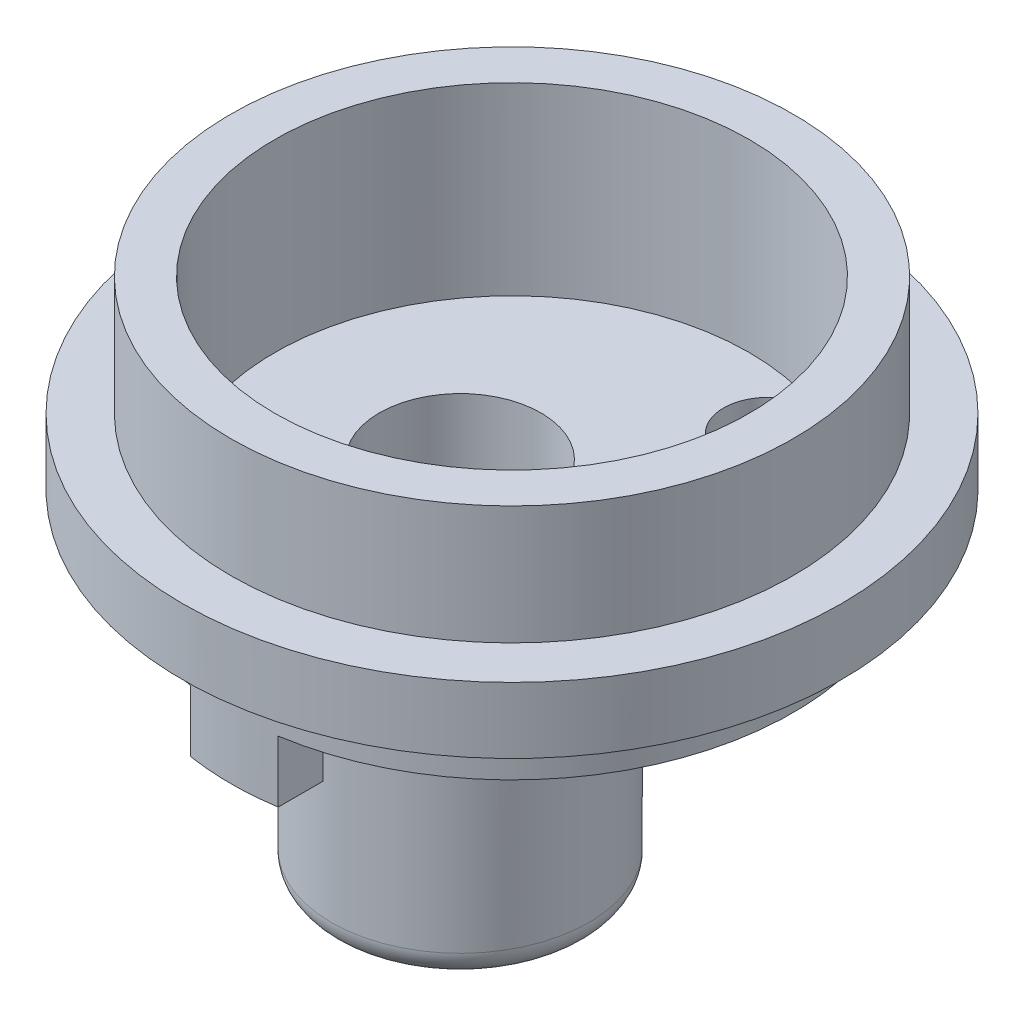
ISO-10303-21;
HEADER;
FILE_DESCRIPTION(('STEP AP214'),'2;1');
FILE_NAME('part.step','',(''),(''),'','','');
FILE_SCHEMA(('AUTOMOTIVE_DESIGN { 1 0 10303 214 1 1 1 1 }'));
ENDSEC;
DATA;
#1=APPLICATION_CONTEXT('core data for automotive mechanical design processes');
#2=APPLICATION_PROTOCOL_DEFINITION('international standard','automotive_design',2000,#1);
#3=PRODUCT_CONTEXT('',#1,'mechanical');
#4=PRODUCT('Part','Part','',(#3));
#5=PRODUCT_RELATED_PRODUCT_CATEGORY('part','',(#4));
#6=PRODUCT_DEFINITION_FORMATION('','',#4);
#7=PRODUCT_DEFINITION_CONTEXT('part definition',#1,'design');
#8=PRODUCT_DEFINITION('design','',#6,#7);
#9=PRODUCT_DEFINITION_SHAPE('','',#8);
#10=(LENGTH_UNIT() NAMED_UNIT(*) SI_UNIT(.MILLI.,.METRE.));
#11=(NAMED_UNIT(*) PLANE_ANGLE_UNIT() SI_UNIT($,.RADIAN.));
#12=(NAMED_UNIT(*) SI_UNIT($,.STERADIAN.) SOLID_ANGLE_UNIT());
#13=UNCERTAINTY_MEASURE_WITH_UNIT(LENGTH_MEASURE(1.E-05),#10,'distance_accuracy_value','');
#14=(GEOMETRIC_REPRESENTATION_CONTEXT(3) GLOBAL_UNCERTAINTY_ASSIGNED_CONTEXT((#13)) GLOBAL_UNIT_ASSIGNED_CONTEXT((#10,
#11,#12)) REPRESENTATION_CONTEXT('',''));
#15=CARTESIAN_POINT('',(0.,0.,0.));
#16=DIRECTION('',(0.,0.,1.));
#17=DIRECTION('',(1.,0.,0.));
#18=AXIS2_PLACEMENT_3D('',#15,#16,#17);
#19=CARTESIAN_POINT('',(0.,0.,0.));
#20=DIRECTION('',(0.,1.,0.));
#21=DIRECTION('',(0.,0.,1.));
#22=AXIS2_PLACEMENT_3D('',#19,#20,#21);
#23=PLANE('',#22);
#24=CARTESIAN_POINT('',(-1.4986,0.,0.));
#25=DIRECTION('',(0.,1.,0.));
#26=DIRECTION('',(0.,0.,1.));
#27=AXIS2_PLACEMENT_3D('',#24,#25,#26);
#28=CIRCLE('',#27,5.08);
#29=CARTESIAN_POINT('',(0.567898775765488,0.,4.64068775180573));
#30=VERTEX_POINT('',#29);
#31=CARTESIAN_POINT('',(0.567898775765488,0.,-4.64068775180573));
#32=VERTEX_POINT('',#31);
#33=EDGE_CURVE('E160',#30,#32,#28,.F.);
#34=ORIENTED_EDGE('',*,*,#33,.F.);
#35=CARTESIAN_POINT('',(2.28578474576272,0.,5.09911091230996));
#36=DIRECTION('',(0.,1.,0.));
#37=DIRECTION('',(0.,0.,1.));
#38=AXIS2_PLACEMENT_3D('',#35,#36,#37);
#39=CIRCLE('',#38,1.778);
#40=CARTESIAN_POINT('',(3.01307989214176,0.,6.72155529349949));
#41=VERTEX_POINT('',#40);
#42=EDGE_CURVE('E184',#30,#41,#39,.T.);
#43=ORIENTED_EDGE('',*,*,#42,.T.);
#44=CARTESIAN_POINT('',(0.,0.,0.));
#45=DIRECTION('',(0.,1.,0.));
#46=DIRECTION('',(0.,0.,1.));
#47=AXIS2_PLACEMENT_3D('',#44,#45,#46);
#48=CIRCLE('',#47,7.366);
#49=CARTESIAN_POINT('',(3.01307989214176,0.,-6.72155529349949));
#50=VERTEX_POINT('',#49);
#51=EDGE_CURVE('E180',#41,#50,#48,.T.);
#52=ORIENTED_EDGE('',*,*,#51,.T.);
#53=CARTESIAN_POINT('',(2.28578474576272,0.,-5.09911091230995));
#54=DIRECTION('',(0.,1.,0.));
#55=DIRECTION('',(0.,0.,1.));
#56=AXIS2_PLACEMENT_3D('',#53,#54,#55);
#57=CIRCLE('',#56,1.778);
#58=EDGE_CURVE('E182',#50,#32,#57,.T.);
#59=ORIENTED_EDGE('',*,*,#58,.T.);
#60=EDGE_LOOP('',(#34,#43,#52,#59));
#61=FACE_BOUND('',#60,.T.);
#62=CARTESIAN_POINT('',(0.,0.,0.));
#63=DIRECTION('',(0.,-1.,0.));
#64=DIRECTION('',(0.,0.,-1.));
#65=AXIS2_PLACEMENT_3D('',#62,#63,#64);
#66=CIRCLE('',#65,6.858);
#67=CARTESIAN_POINT('',(-1.27,0.,-6.73938157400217));
#68=VERTEX_POINT('',#67);
#69=CARTESIAN_POINT('',(1.27,0.,-6.73938157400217));
#70=VERTEX_POINT('',#69);
#71=EDGE_CURVE('E150',#68,#70,#66,.T.);
#72=ORIENTED_EDGE('',*,*,#71,.T.);
#73=DIRECTION('',(0.,0.,-1.));
#74=VECTOR('',#73,1.);
#75=CARTESIAN_POINT('',(1.27,0.,-6.73938157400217));
#76=LINE('',#75,#74);
#77=CARTESIAN_POINT('',(1.27,0.,-8.02816815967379));
#78=VERTEX_POINT('',#77);
#79=EDGE_CURVE('E134',#70,#78,#76,.T.);
#80=ORIENTED_EDGE('',*,*,#79,.T.);
#81=CARTESIAN_POINT('',(0.,0.,0.));
#82=DIRECTION('',(0.,1.,0.));
#83=DIRECTION('',(0.,0.,1.));
#84=AXIS2_PLACEMENT_3D('',#81,#82,#83);
#85=CIRCLE('',#84,8.128);
#86=CARTESIAN_POINT('',(1.27,0.,8.02816815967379));
#87=VERTEX_POINT('',#86);
#88=EDGE_CURVE('E147',#87,#78,#85,.T.);
#89=ORIENTED_EDGE('',*,*,#88,.F.);
#90=DIRECTION('',(0.,0.,-1.));
#91=VECTOR('',#90,1.);
#92=CARTESIAN_POINT('',(1.27,0.,8.02816815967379));
#93=LINE('',#92,#91);
#94=CARTESIAN_POINT('',(1.27,0.,6.73938157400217));
#95=VERTEX_POINT('',#94);
#96=EDGE_CURVE('E385',#87,#95,#93,.T.);
#97=ORIENTED_EDGE('',*,*,#96,.T.);
#98=CARTESIAN_POINT('',(0.,0.,0.));
#99=DIRECTION('',(0.,-1.,0.));
#100=DIRECTION('',(0.,0.,-1.));
#101=AXIS2_PLACEMENT_3D('',#98,#99,#100);
#102=CIRCLE('',#101,6.858);
#103=CARTESIAN_POINT('',(-1.27,0.,6.73938157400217));
#104=VERTEX_POINT('',#103);
#105=EDGE_CURVE('E382',#95,#104,#102,.T.);
#106=ORIENTED_EDGE('',*,*,#105,.T.);
#107=DIRECTION('',(0.,0.,-1.));
#108=VECTOR('',#107,1.);
#109=CARTESIAN_POINT('',(-1.27,0.,8.02816815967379));
#110=LINE('',#109,#108);
#111=CARTESIAN_POINT('',(-1.27,0.,8.02816815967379));
#112=VERTEX_POINT('',#111);
#113=EDGE_CURVE('E141',#112,#104,#110,.T.);
#114=ORIENTED_EDGE('',*,*,#113,.F.);
#115=CARTESIAN_POINT('',(-1.27,0.,-8.02816815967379));
#116=VERTEX_POINT('',#115);
#117=EDGE_CURVE('E157',#116,#112,#85,.T.);
#118=ORIENTED_EDGE('',*,*,#117,.F.);
#119=DIRECTION('',(0.,0.,-1.));
#120=VECTOR('',#119,1.);
#121=CARTESIAN_POINT('',(-1.27,0.,-6.73938157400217));
#122=LINE('',#121,#120);
#123=EDGE_CURVE('E364',#68,#116,#122,.T.);
#124=ORIENTED_EDGE('',*,*,#123,.F.);
#125=EDGE_LOOP('',(#72,#80,#89,#97,#106,#114,#118,#124));
#126=FACE_BOUND('',#125,.T.);
#127=ADVANCED_FACE('F28',(#61,#126),#23,.F.);
#128=CARTESIAN_POINT('',(0.,1.524,0.));
#129=DIRECTION('',(0.,-1.,0.));
#130=DIRECTION('',(0.,0.,-1.));
#131=AXIS2_PLACEMENT_3D('',#128,#129,#130);
#132=PLANE('',#131);
#133=CARTESIAN_POINT('',(-1.4986,1.524,0.));
#134=DIRECTION('',(0.,1.,0.));
#135=DIRECTION('',(-1.,0.,0.));
#136=AXIS2_PLACEMENT_3D('',#133,#134,#135);
#137=CIRCLE('',#136,2.33679999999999);
#138=CARTESIAN_POINT('',(-3.8354,1.524,0.));
#139=VERTEX_POINT('',#138);
#140=EDGE_CURVE('E295',#139,#139,#137,.T.);
#141=ORIENTED_EDGE('',*,*,#140,.F.);
#142=EDGE_LOOP('',(#141));
#143=FACE_BOUND('',#142,.T.);
#144=CARTESIAN_POINT('',(2.28578474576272,1.524,5.09911091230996));
#145=DIRECTION('',(0.,-1.,0.));
#146=DIRECTION('',(0.,0.,-1.));
#147=AXIS2_PLACEMENT_3D('',#144,#145,#146);
#148=CIRCLE('',#147,1.27);
#149=CARTESIAN_POINT('',(2.80528127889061,1.524,6.25799975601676));
#150=VERTEX_POINT('',#149);
#151=CARTESIAN_POINT('',(1.52890779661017,1.524,4.07928872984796));
#152=VERTEX_POINT('',#151);
#153=EDGE_CURVE('E320',#150,#152,#148,.T.);
#154=ORIENTED_EDGE('',*,*,#153,.T.);
#155=CARTESIAN_POINT('',(-1.4986,1.524,0.));
#156=DIRECTION('',(0.,1.,0.));
#157=DIRECTION('',(0.,0.,1.));
#158=AXIS2_PLACEMENT_3D('',#155,#156,#157);
#159=CIRCLE('',#158,5.08);
#160=CARTESIAN_POINT('',(1.52890779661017,1.524,-4.07928872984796));
#161=VERTEX_POINT('',#160);
#162=EDGE_CURVE('E323',#152,#161,#159,.T.);
#163=ORIENTED_EDGE('',*,*,#162,.T.);
#164=CARTESIAN_POINT('',(2.28578474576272,1.524,-5.09911091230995));
#165=DIRECTION('',(0.,1.,0.));
#166=DIRECTION('',(0.,0.,1.));
#167=AXIS2_PLACEMENT_3D('',#164,#165,#166);
#168=CIRCLE('',#167,1.27);
#169=CARTESIAN_POINT('',(2.80528127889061,1.524,-6.25799975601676));
#170=VERTEX_POINT('',#169);
#171=EDGE_CURVE('E328',#170,#161,#168,.T.);
#172=ORIENTED_EDGE('',*,*,#171,.F.);
#173=CARTESIAN_POINT('',(0.,1.524,0.));
#174=DIRECTION('',(0.,-1.,0.));
#175=DIRECTION('',(0.,0.,-1.));
#176=AXIS2_PLACEMENT_3D('',#173,#174,#175);
#177=CIRCLE('',#176,6.858);
#178=EDGE_CURVE('E238',#150,#170,#177,.T.);
#179=ORIENTED_EDGE('',*,*,#178,.F.);
#180=EDGE_LOOP('',(#154,#163,#172,#179));
#181=FACE_BOUND('',#180,.T.);
#182=ADVANCED_FACE('F213',(#143,#181),#132,.F.);
#183=CARTESIAN_POINT('',(0.,6.858,0.));
#184=DIRECTION('',(0.,-1.,0.));
#185=DIRECTION('',(0.,0.,-1.));
#186=AXIS2_PLACEMENT_3D('',#183,#184,#185);
#187=CYLINDRICAL_SURFACE('',#186,8.128);
#188=CARTESIAN_POINT('',(0.,1.524,0.));
#189=DIRECTION('',(0.,-1.,0.));
#190=DIRECTION('',(0.,0.,-1.));
#191=AXIS2_PLACEMENT_3D('',#188,#189,#190);
#192=CIRCLE('',#191,8.128);
#193=CARTESIAN_POINT('',(0.,1.524,-8.128));
#194=VERTEX_POINT('',#193);
#195=EDGE_CURVE('E171',#194,#194,#192,.T.);
#196=ORIENTED_EDGE('',*,*,#195,.T.);
#197=EDGE_LOOP('',(#196));
#198=FACE_BOUND('',#197,.T.);
#199=ORIENTED_EDGE('',*,*,#88,.T.);
#200=DIRECTION('',(0.,1.,0.));
#201=VECTOR('',#200,1.);
#202=CARTESIAN_POINT('',(1.27,-1.778,-8.02816815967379));
#203=LINE('',#202,#201);
#204=CARTESIAN_POINT('',(1.27,-1.778,-8.02816815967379));
#205=VERTEX_POINT('',#204);
#206=EDGE_CURVE('E131',#205,#78,#203,.T.);
#207=ORIENTED_EDGE('',*,*,#206,.F.);
#208=CARTESIAN_POINT('',(0.,-1.778,0.));
#209=DIRECTION('',(0.,-1.,0.));
#210=DIRECTION('',(0.,0.,-1.));
#211=AXIS2_PLACEMENT_3D('',#208,#209,#210);
#212=CIRCLE('',#211,8.128);
#213=CARTESIAN_POINT('',(-1.27,-1.778,-8.02816815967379));
#214=VERTEX_POINT('',#213);
#215=EDGE_CURVE('E367',#214,#205,#212,.T.);
#216=ORIENTED_EDGE('',*,*,#215,.F.);
#217=DIRECTION('',(0.,1.,0.));
#218=VECTOR('',#217,1.);
#219=CARTESIAN_POINT('',(-1.27,-1.778,-8.02816815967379));
#220=LINE('',#219,#218);
#221=EDGE_CURVE('E375',#214,#116,#220,.T.);
#222=ORIENTED_EDGE('',*,*,#221,.T.);
#223=ORIENTED_EDGE('',*,*,#117,.T.);
#224=DIRECTION('',(0.,1.,0.));
#225=VECTOR('',#224,1.);
#226=CARTESIAN_POINT('',(-1.27,-1.778,8.02816815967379));
#227=LINE('',#226,#225);
#228=CARTESIAN_POINT('',(-1.27,-1.778,8.02816815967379));
#229=VERTEX_POINT('',#228);
#230=EDGE_CURVE('E326',#229,#112,#227,.T.);
#231=ORIENTED_EDGE('',*,*,#230,.F.);
#232=CARTESIAN_POINT('',(0.,-1.778,0.));
#233=DIRECTION('',(0.,-1.,0.));
#234=DIRECTION('',(0.,0.,-1.));
#235=AXIS2_PLACEMENT_3D('',#232,#233,#234);
#236=CIRCLE('',#235,8.128);
#237=CARTESIAN_POINT('',(1.27,-1.778,8.02816815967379));
#238=VERTEX_POINT('',#237);
#239=EDGE_CURVE('E387',#238,#229,#236,.T.);
#240=ORIENTED_EDGE('',*,*,#239,.F.);
#241=DIRECTION('',(0.,1.,0.));
#242=VECTOR('',#241,1.);
#243=CARTESIAN_POINT('',(1.27,-1.778,8.02816815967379));
#244=LINE('',#243,#242);
#245=EDGE_CURVE('E155',#238,#87,#244,.T.);
#246=ORIENTED_EDGE('',*,*,#245,.T.);
#247=EDGE_LOOP('',(#199,#207,#216,#222,#223,#231,#240,#246));
#248=FACE_BOUND('',#247,.T.);
#249=ADVANCED_FACE('F30',(#198,#248),#187,.T.);
#250=CARTESIAN_POINT('',(-1.4986,-2.54,0.));
#251=DIRECTION('',(0.,1.,0.));
#252=DIRECTION('',(0.,0.,1.));
#253=AXIS2_PLACEMENT_3D('',#250,#251,#252);
#254=CYLINDRICAL_SURFACE('',#253,5.08);
#255=DIRECTION('',(0.,1.,0.));
#256=VECTOR('',#255,1.);
#257=CARTESIAN_POINT('',(1.52890779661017,-8.9662,4.07928872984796));
#258=LINE('',#257,#256);
#259=CARTESIAN_POINT('',(1.52890779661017,0.508,4.07928872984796));
#260=VERTEX_POINT('',#259);
#261=EDGE_CURVE('E300',#260,#152,#258,.T.);
#262=ORIENTED_EDGE('',*,*,#261,.F.);
#263=CARTESIAN_POINT('',(0.567898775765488,0.,4.64068775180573));
#264=CARTESIAN_POINT('',(0.618864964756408,5.12373952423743E-05,4.61801161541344));
#265=CARTESIAN_POINT('',(0.669077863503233,0.00553166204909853,4.59462833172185));
#266=CARTESIAN_POINT('',(0.766715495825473,0.0249706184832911,4.5472627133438));
#267=CARTESIAN_POINT('',(0.814169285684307,0.0388102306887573,4.52329322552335));
#268=CARTESIAN_POINT('',(0.941170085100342,0.0854665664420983,4.45671525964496));
#269=CARTESIAN_POINT('',(1.01800450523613,0.124727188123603,4.41365014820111));
#270=CARTESIAN_POINT('',(1.16492275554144,0.214242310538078,4.32659484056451));
#271=CARTESIAN_POINT('',(1.23494680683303,0.264583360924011,4.28259997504));
#272=CARTESIAN_POINT('',(1.37918595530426,0.377555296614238,4.18726831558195));
#273=CARTESIAN_POINT('',(1.45268033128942,0.440926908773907,4.13574536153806));
#274=CARTESIAN_POINT('',(1.52612075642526,0.505546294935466,4.0813560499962));
#275=CARTESIAN_POINT('',(1.52751454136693,0.506773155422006,4.08032273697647));
#276=CARTESIAN_POINT('',(1.52890779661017,0.508,4.07928872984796));
#277=B_SPLINE_CURVE_WITH_KNOTS('',3,(#263,#264,#265,#266,#267,#268,#269,#270,#271,#272,#273,
#274,#275,#276),.UNSPECIFIED.,.F.,.F.,(4,2,2,2,2,2,4),(0.,0.166504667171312,0.3306946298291,
0.618403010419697,0.908443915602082,1.23784315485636,1.24421810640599),.UNSPECIFIED.);
#278=EDGE_CURVE('E189',#260,#30,#277,.F.);
#279=ORIENTED_EDGE('',*,*,#278,.T.);
#280=ORIENTED_EDGE('',*,*,#33,.T.);
#281=CARTESIAN_POINT('',(0.567898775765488,0.,-4.64068775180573));
#282=CARTESIAN_POINT('',(0.618864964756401,5.12373952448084E-05,-4.61801161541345));
#283=CARTESIAN_POINT('',(0.669077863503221,0.00553166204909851,-4.59462833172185));
#284=CARTESIAN_POINT('',(0.766715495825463,0.0249706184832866,-4.54726271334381));
#285=CARTESIAN_POINT('',(0.814169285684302,0.0388102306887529,-4.52329322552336));
#286=CARTESIAN_POINT('',(0.941170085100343,0.0854665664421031,-4.45671525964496));
#287=CARTESIAN_POINT('',(1.01800450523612,0.124727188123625,-4.41365014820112));
#288=CARTESIAN_POINT('',(1.16492275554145,0.214242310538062,-4.3265948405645));
#289=CARTESIAN_POINT('',(1.23494680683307,0.264583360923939,-4.28259997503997));
#290=CARTESIAN_POINT('',(1.37918595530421,0.377555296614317,-4.18726831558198));
#291=CARTESIAN_POINT('',(1.45268033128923,0.440926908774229,-4.13574536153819));
#292=CARTESIAN_POINT('',(1.52612075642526,0.505546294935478,-4.08135604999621));
#293=CARTESIAN_POINT('',(1.52751454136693,0.506773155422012,-4.08032273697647));
#294=CARTESIAN_POINT('',(1.52890779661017,0.508,-4.07928872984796));
#295=B_SPLINE_CURVE_WITH_KNOTS('',3,(#281,#282,#283,#284,#285,#286,#287,#288,#289,#290,#291,
#292,#293,#294),.UNSPECIFIED.,.F.,.F.,(4,2,2,2,2,2,4),(0.,0.166504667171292,0.330694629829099,
0.61840301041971,0.908443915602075,1.23784315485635,1.24421810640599),.UNSPECIFIED.);
#296=CARTESIAN_POINT('',(1.52890779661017,0.508,-4.07928872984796));
#297=VERTEX_POINT('',#296);
#298=EDGE_CURVE('E43',#32,#297,#295,.T.);
#299=ORIENTED_EDGE('',*,*,#298,.T.);
#300=DIRECTION('',(0.,1.,0.));
#301=VECTOR('',#300,1.);
#302=CARTESIAN_POINT('',(1.52890779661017,-8.9662,-4.07928872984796));
#303=LINE('',#302,#301);
#304=EDGE_CURVE('E341',#297,#161,#303,.T.);
#305=ORIENTED_EDGE('',*,*,#304,.T.);
#306=ORIENTED_EDGE('',*,*,#162,.F.);
#307=EDGE_LOOP('',(#262,#279,#280,#299,#305,#306));
#308=FACE_BOUND('',#307,.T.);
#309=CARTESIAN_POINT('',(-1.4986,-2.54,0.));
#310=DIRECTION('',(0.,-1.,0.));
#311=DIRECTION('',(0.,0.,-1.));
#312=AXIS2_PLACEMENT_3D('',#309,#310,#311);
#313=CIRCLE('',#312,5.08);
#314=CARTESIAN_POINT('',(-1.4986,-2.54,-5.08));
#315=VERTEX_POINT('',#314);
#316=EDGE_CURVE('E162',#315,#315,#313,.T.);
#317=ORIENTED_EDGE('',*,*,#316,.F.);
#318=EDGE_LOOP('',(#317));
#319=FACE_BOUND('',#318,.T.);
#320=ADVANCED_FACE('F204',(#308,#319),#254,.T.);
#321=CARTESIAN_POINT('',(-1.4986,-2.54,0.));
#322=DIRECTION('',(0.,-1.,0.));
#323=DIRECTION('',(0.,0.,-1.));
#324=AXIS2_PLACEMENT_3D('',#321,#322,#323);
#325=PLANE('',#324);
#326=CARTESIAN_POINT('',(-1.4986,-2.54,0.));
#327=DIRECTION('',(0.,-1.,0.));
#328=DIRECTION('',(0.,0.,-1.));
#329=AXIS2_PLACEMENT_3D('',#326,#327,#328);
#330=CIRCLE('',#329,3.72467038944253);
#331=CARTESIAN_POINT('',(-1.4986,-2.54,-3.72467038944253));
#332=VERTEX_POINT('',#331);
#333=EDGE_CURVE('E167',#332,#332,#330,.T.);
#334=ORIENTED_EDGE('',*,*,#333,.F.);
#335=EDGE_LOOP('',(#334));
#336=FACE_BOUND('',#335,.T.);
#337=ORIENTED_EDGE('',*,*,#316,.T.);
#338=EDGE_LOOP('',(#337));
#339=FACE_BOUND('',#338,.T.);
#340=ADVANCED_FACE('F209',(#336,#339),#325,.T.);
#341=CARTESIAN_POINT('',(-1.4986,-8.9662,0.));
#342=DIRECTION('',(0.,1.,0.));
#343=DIRECTION('',(0.,0.,1.));
#344=AXIS2_PLACEMENT_3D('',#341,#342,#343);
#345=CYLINDRICAL_SURFACE('',#344,3.72467038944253);
#346=CARTESIAN_POINT('',(-1.4986,-8.2042,0.));
#347=DIRECTION('',(0.,1.,0.));
#348=DIRECTION('',(0.,0.,1.));
#349=AXIS2_PLACEMENT_3D('',#346,#347,#348);
#350=CIRCLE('',#349,3.72467038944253);
#351=CARTESIAN_POINT('',(-1.4986,-8.2042,3.72467038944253));
#352=VERTEX_POINT('',#351);
#353=EDGE_CURVE('E36',#352,#352,#350,.T.);
#354=ORIENTED_EDGE('',*,*,#353,.T.);
#355=EDGE_LOOP('',(#354));
#356=FACE_BOUND('',#355,.T.);
#357=ORIENTED_EDGE('',*,*,#333,.T.);
#358=EDGE_LOOP('',(#357));
#359=FACE_BOUND('',#358,.T.);
#360=ADVANCED_FACE('F262',(#356,#359),#345,.T.);
#361=CARTESIAN_POINT('',(-1.4986,-8.9662,0.));
#362=DIRECTION('',(0.,1.,0.));
#363=DIRECTION('',(0.,0.,1.));
#364=AXIS2_PLACEMENT_3D('',#361,#362,#363);
#365=PLANE('',#364);
#366=CARTESIAN_POINT('',(-1.4986,-8.9662,0.));
#367=DIRECTION('',(0.,1.,0.));
#368=DIRECTION('',(0.,0.,1.));
#369=AXIS2_PLACEMENT_3D('',#366,#367,#368);
#370=CIRCLE('',#369,2.96267038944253);
#371=CARTESIAN_POINT('',(-1.4986,-8.9662,2.96267038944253));
#372=VERTEX_POINT('',#371);
#373=EDGE_CURVE('E11',#372,#372,#370,.F.);
#374=ORIENTED_EDGE('',*,*,#373,.T.);
#375=EDGE_LOOP('',(#374));
#376=FACE_BOUND('',#375,.T.);
#377=CARTESIAN_POINT('',(-1.4986,-8.9662,0.));
#378=DIRECTION('',(0.,1.,0.));
#379=DIRECTION('',(-1.,0.,0.));
#380=AXIS2_PLACEMENT_3D('',#377,#378,#379);
#381=CIRCLE('',#380,1.9304);
#382=CARTESIAN_POINT('',(-3.429,-8.9662,0.));
#383=VERTEX_POINT('',#382);
#384=EDGE_CURVE('E292',#383,#383,#381,.T.);
#385=ORIENTED_EDGE('',*,*,#384,.T.);
#386=EDGE_LOOP('',(#385));
#387=FACE_BOUND('',#386,.T.);
#388=ADVANCED_FACE('F253',(#376,#387),#365,.F.);
#389=CARTESIAN_POINT('',(0.,3.429,0.));
#390=DIRECTION('',(0.,1.,0.));
#391=DIRECTION('',(0.,0.,1.));
#392=AXIS2_PLACEMENT_3D('',#389,#390,#391);
#393=PLANE('',#392);
#394=CARTESIAN_POINT('',(0.,3.429,0.));
#395=DIRECTION('',(0.,1.,0.));
#396=DIRECTION('',(0.,0.,1.));
#397=AXIS2_PLACEMENT_3D('',#394,#395,#396);
#398=CIRCLE('',#397,9.525);
#399=CARTESIAN_POINT('',(0.,3.429,9.525));
#400=VERTEX_POINT('',#399);
#401=EDGE_CURVE('E175',#400,#400,#398,.F.);
#402=ORIENTED_EDGE('',*,*,#401,.F.);
#403=EDGE_LOOP('',(#402));
#404=FACE_BOUND('',#403,.T.);
#405=CARTESIAN_POINT('',(0.,3.429,0.));
#406=DIRECTION('',(0.,1.,0.));
#407=DIRECTION('',(0.,0.,1.));
#408=AXIS2_PLACEMENT_3D('',#405,#406,#407);
#409=CIRCLE('',#408,8.128);
#410=CARTESIAN_POINT('',(0.,3.429,8.128));
#411=VERTEX_POINT('',#410);
#412=EDGE_CURVE('E174',#411,#411,#409,.T.);
#413=ORIENTED_EDGE('',*,*,#412,.F.);
#414=EDGE_LOOP('',(#413));
#415=FACE_BOUND('',#414,.T.);
#416=ADVANCED_FACE('F250',(#404,#415),#393,.T.);
#417=CARTESIAN_POINT('',(0.,1.524,0.));
#418=DIRECTION('',(0.,-1.,0.));
#419=DIRECTION('',(0.,0.,-1.));
#420=AXIS2_PLACEMENT_3D('',#417,#418,#419);
#421=PLANE('',#420);
#422=CARTESIAN_POINT('',(0.,1.524,0.));
#423=DIRECTION('',(0.,-1.,0.));
#424=DIRECTION('',(0.,0.,-1.));
#425=AXIS2_PLACEMENT_3D('',#422,#423,#424);
#426=CIRCLE('',#425,9.525);
#427=CARTESIAN_POINT('',(0.,1.524,-9.525));
#428=VERTEX_POINT('',#427);
#429=EDGE_CURVE('E237',#428,#428,#426,.T.);
#430=ORIENTED_EDGE('',*,*,#429,.T.);
#431=EDGE_LOOP('',(#430));
#432=FACE_BOUND('',#431,.T.);
#433=ORIENTED_EDGE('',*,*,#195,.F.);
#434=EDGE_LOOP('',(#433));
#435=FACE_BOUND('',#434,.T.);
#436=ADVANCED_FACE('F227',(#432,#435),#421,.T.);
#437=CARTESIAN_POINT('',(0.,33.7987683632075,0.));
#438=DIRECTION('',(0.,-1.,0.));
#439=DIRECTION('',(0.,0.,-1.));
#440=AXIS2_PLACEMENT_3D('',#437,#438,#439);
#441=CYLINDRICAL_SURFACE('',#440,9.525);
#442=ORIENTED_EDGE('',*,*,#429,.F.);
#443=EDGE_LOOP('',(#442));
#444=FACE_BOUND('',#443,.T.);
#445=ORIENTED_EDGE('',*,*,#401,.T.);
#446=EDGE_LOOP('',(#445));
#447=FACE_BOUND('',#446,.T.);
#448=ADVANCED_FACE('F218',(#444,#447),#441,.T.);
#449=CARTESIAN_POINT('',(0.,6.858,0.));
#450=DIRECTION('',(0.,1.,0.));
#451=DIRECTION('',(0.,0.,1.));
#452=AXIS2_PLACEMENT_3D('',#449,#450,#451);
#453=PLANE('',#452);
#454=CARTESIAN_POINT('',(0.,6.858,0.));
#455=DIRECTION('',(0.,-1.,0.));
#456=DIRECTION('',(0.,0.,-1.));
#457=AXIS2_PLACEMENT_3D('',#454,#455,#456);
#458=CIRCLE('',#457,6.858);
#459=CARTESIAN_POINT('',(0.,6.858,-6.858));
#460=VERTEX_POINT('',#459);
#461=EDGE_CURVE('E233',#460,#460,#458,.T.);
#462=ORIENTED_EDGE('',*,*,#461,.T.);
#463=EDGE_LOOP('',(#462));
#464=FACE_BOUND('',#463,.T.);
#465=CARTESIAN_POINT('',(0.,6.858,0.));
#466=DIRECTION('',(0.,1.,0.));
#467=DIRECTION('',(0.,0.,1.));
#468=AXIS2_PLACEMENT_3D('',#465,#466,#467);
#469=CIRCLE('',#468,8.128);
#470=CARTESIAN_POINT('',(0.,6.858,8.128));
#471=VERTEX_POINT('',#470);
#472=EDGE_CURVE('E156',#471,#471,#469,.T.);
#473=ORIENTED_EDGE('',*,*,#472,.T.);
#474=EDGE_LOOP('',(#473));
#475=FACE_BOUND('',#474,.T.);
#476=ADVANCED_FACE('F215',(#464,#475),#453,.T.);
#477=ORIENTED_EDGE('',*,*,#412,.T.);
#478=EDGE_LOOP('',(#477));
#479=FACE_BOUND('',#478,.T.);
#480=ORIENTED_EDGE('',*,*,#472,.F.);
#481=EDGE_LOOP('',(#480));
#482=FACE_BOUND('',#481,.T.);
#483=ADVANCED_FACE('F217',(#479,#482),#187,.T.);
#484=CARTESIAN_POINT('',(0.,6.858,0.));
#485=DIRECTION('',(0.,-1.,0.));
#486=DIRECTION('',(0.,0.,-1.));
#487=AXIS2_PLACEMENT_3D('',#484,#485,#486);
#488=CYLINDRICAL_SURFACE('',#487,6.858);
#489=ORIENTED_EDGE('',*,*,#461,.F.);
#490=EDGE_LOOP('',(#489));
#491=FACE_BOUND('',#490,.T.);
#492=DIRECTION('',(0.,1.,0.));
#493=VECTOR('',#492,1.);
#494=CARTESIAN_POINT('',(2.80528127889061,-8.9662,-6.25799975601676));
#495=LINE('',#494,#493);
#496=CARTESIAN_POINT('',(2.80528127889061,0.508,-6.25799975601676));
#497=VERTEX_POINT('',#496);
#498=EDGE_CURVE('E339',#497,#170,#495,.T.);
#499=ORIENTED_EDGE('',*,*,#498,.F.);
#500=CARTESIAN_POINT('',(0.,0.508,0.));
#501=DIRECTION('',(0.,1.,0.));
#502=DIRECTION('',(0.,0.,1.));
#503=AXIS2_PLACEMENT_3D('',#500,#501,#502);
#504=CIRCLE('',#503,6.858);
#505=CARTESIAN_POINT('',(2.80528127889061,0.508,6.25799975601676));
#506=VERTEX_POINT('',#505);
#507=EDGE_CURVE('E187',#497,#506,#504,.F.);
#508=ORIENTED_EDGE('',*,*,#507,.T.);
#509=DIRECTION('',(0.,1.,0.));
#510=VECTOR('',#509,1.);
#511=CARTESIAN_POINT('',(2.80528127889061,-8.9662,6.25799975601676));
#512=LINE('',#511,#510);
#513=EDGE_CURVE('E337',#506,#150,#512,.T.);
#514=ORIENTED_EDGE('',*,*,#513,.T.);
#515=ORIENTED_EDGE('',*,*,#178,.T.);
#516=EDGE_LOOP('',(#499,#508,#514,#515));
#517=FACE_BOUND('',#516,.T.);
#518=ADVANCED_FACE('F224',(#491,#517),#488,.F.);
#519=CARTESIAN_POINT('',(-1.4986,5.36518646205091,0.));
#520=DIRECTION('',(0.,1.,0.));
#521=DIRECTION('',(-1.,0.,0.));
#522=AXIS2_PLACEMENT_3D('',#519,#520,#521);
#523=CYLINDRICAL_SURFACE('',#522,2.33679999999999);
#524=CARTESIAN_POINT('',(-1.4986,-3.81,0.));
#525=DIRECTION('',(0.,1.,0.));
#526=DIRECTION('',(-1.,0.,0.));
#527=AXIS2_PLACEMENT_3D('',#524,#525,#526);
#528=CIRCLE('',#527,2.3368);
#529=CARTESIAN_POINT('',(-3.8354,-3.81,0.));
#530=VERTEX_POINT('',#529);
#531=EDGE_CURVE('E243',#530,#530,#528,.T.);
#532=ORIENTED_EDGE('',*,*,#531,.F.);
#533=EDGE_LOOP('',(#532));
#534=FACE_BOUND('',#533,.T.);
#535=ORIENTED_EDGE('',*,*,#140,.T.);
#536=EDGE_LOOP('',(#535));
#537=FACE_BOUND('',#536,.T.);
#538=ADVANCED_FACE('F308',(#534,#537),#523,.F.);
#539=CARTESIAN_POINT('',(-1.4986,-3.81,0.));
#540=DIRECTION('',(0.,1.,0.));
#541=DIRECTION('',(-1.,0.,0.));
#542=AXIS2_PLACEMENT_3D('',#539,#540,#541);
#543=CONICAL_SURFACE('',#542,2.33679999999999,0.132481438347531);
#544=CARTESIAN_POINT('',(-1.4986,-6.85963169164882,0.));
#545=DIRECTION('',(0.,1.,0.));
#546=DIRECTION('',(-1.,0.,0.));
#547=AXIS2_PLACEMENT_3D('',#544,#545,#546);
#548=CIRCLE('',#547,1.9304);
#549=CARTESIAN_POINT('',(-3.429,-6.85963169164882,0.));
#550=VERTEX_POINT('',#549);
#551=EDGE_CURVE('E294',#550,#550,#548,.T.);
#552=ORIENTED_EDGE('',*,*,#551,.F.);
#553=EDGE_LOOP('',(#552));
#554=FACE_BOUND('',#553,.T.);
#555=ORIENTED_EDGE('',*,*,#531,.T.);
#556=EDGE_LOOP('',(#555));
#557=FACE_BOUND('',#556,.T.);
#558=ADVANCED_FACE('F306',(#554,#557),#543,.F.);
#559=CARTESIAN_POINT('',(-1.4986,5.36518646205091,0.));
#560=DIRECTION('',(0.,1.,0.));
#561=DIRECTION('',(-1.,0.,0.));
#562=AXIS2_PLACEMENT_3D('',#559,#560,#561);
#563=CYLINDRICAL_SURFACE('',#562,1.9304);
#564=ORIENTED_EDGE('',*,*,#384,.F.);
#565=EDGE_LOOP('',(#564));
#566=FACE_BOUND('',#565,.T.);
#567=ORIENTED_EDGE('',*,*,#551,.T.);
#568=EDGE_LOOP('',(#567));
#569=FACE_BOUND('',#568,.T.);
#570=ADVANCED_FACE('F449',(#566,#569),#563,.F.);
#571=CARTESIAN_POINT('',(2.28578474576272,-8.9662,5.09911091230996));
#572=DIRECTION('',(0.,1.,0.));
#573=DIRECTION('',(0.,0.,1.));
#574=AXIS2_PLACEMENT_3D('',#571,#572,#573);
#575=CYLINDRICAL_SURFACE('',#574,1.27);
#576=ORIENTED_EDGE('',*,*,#513,.F.);
#577=CARTESIAN_POINT('',(2.28578474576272,0.508,5.09911091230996));
#578=DIRECTION('',(0.,1.,0.));
#579=DIRECTION('',(0.,0.,1.));
#580=AXIS2_PLACEMENT_3D('',#577,#578,#579);
#581=CIRCLE('',#580,1.27);
#582=EDGE_CURVE('E170',#506,#260,#581,.F.);
#583=ORIENTED_EDGE('',*,*,#582,.T.);
#584=ORIENTED_EDGE('',*,*,#261,.T.);
#585=ORIENTED_EDGE('',*,*,#153,.F.);
#586=EDGE_LOOP('',(#576,#583,#584,#585));
#587=FACE_BOUND('',#586,.T.);
#588=ADVANCED_FACE('F343',(#587),#575,.F.);
#589=CARTESIAN_POINT('',(2.28578474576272,-8.9662,-5.09911091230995));
#590=DIRECTION('',(0.,1.,0.));
#591=DIRECTION('',(0.,0.,1.));
#592=AXIS2_PLACEMENT_3D('',#589,#590,#591);
#593=CYLINDRICAL_SURFACE('',#592,1.27);
#594=ORIENTED_EDGE('',*,*,#304,.F.);
#595=CARTESIAN_POINT('',(2.28578474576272,0.508,-5.09911091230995));
#596=DIRECTION('',(0.,1.,0.));
#597=DIRECTION('',(0.,0.,1.));
#598=AXIS2_PLACEMENT_3D('',#595,#596,#597);
#599=CIRCLE('',#598,1.27);
#600=EDGE_CURVE('E50',#297,#497,#599,.F.);
#601=ORIENTED_EDGE('',*,*,#600,.T.);
#602=ORIENTED_EDGE('',*,*,#498,.T.);
#603=ORIENTED_EDGE('',*,*,#171,.T.);
#604=EDGE_LOOP('',(#594,#601,#602,#603));
#605=FACE_BOUND('',#604,.T.);
#606=ADVANCED_FACE('F345',(#605),#593,.F.);
#607=CARTESIAN_POINT('',(-1.27,-1.778,8.02816815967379));
#608=DIRECTION('',(1.,0.,0.));
#609=DIRECTION('',(0.,0.,-1.));
#610=AXIS2_PLACEMENT_3D('',#607,#608,#609);
#611=PLANE('',#610);
#612=ORIENTED_EDGE('',*,*,#113,.T.);
#613=DIRECTION('',(0.,1.,0.));
#614=VECTOR('',#613,1.);
#615=CARTESIAN_POINT('',(-1.27,-1.778,6.73938157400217));
#616=LINE('',#615,#614);
#617=CARTESIAN_POINT('',(-1.27,-1.778,6.73938157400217));
#618=VERTEX_POINT('',#617);
#619=EDGE_CURVE('E331',#618,#104,#616,.T.);
#620=ORIENTED_EDGE('',*,*,#619,.F.);
#621=DIRECTION('',(0.,0.,-1.));
#622=VECTOR('',#621,1.);
#623=CARTESIAN_POINT('',(-1.27,-1.778,8.02816815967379));
#624=LINE('',#623,#622);
#625=EDGE_CURVE('E390',#229,#618,#624,.T.);
#626=ORIENTED_EDGE('',*,*,#625,.F.);
#627=ORIENTED_EDGE('',*,*,#230,.T.);
#628=EDGE_LOOP('',(#612,#620,#626,#627));
#629=FACE_BOUND('',#628,.T.);
#630=ADVANCED_FACE('F407',(#629),#611,.F.);
#631=CARTESIAN_POINT('',(0.,-1.778,0.));
#632=DIRECTION('',(0.,1.,0.));
#633=DIRECTION('',(0.,0.,1.));
#634=AXIS2_PLACEMENT_3D('',#631,#632,#633);
#635=CYLINDRICAL_SURFACE('',#634,6.858);
#636=ORIENTED_EDGE('',*,*,#105,.F.);
#637=DIRECTION('',(0.,1.,0.));
#638=VECTOR('',#637,1.);
#639=CARTESIAN_POINT('',(1.27,-1.778,6.73938157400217));
#640=LINE('',#639,#638);
#641=CARTESIAN_POINT('',(1.27,-1.778,6.73938157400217));
#642=VERTEX_POINT('',#641);
#643=EDGE_CURVE('E399',#642,#95,#640,.T.);
#644=ORIENTED_EDGE('',*,*,#643,.F.);
#645=CARTESIAN_POINT('',(0.,-1.778,0.));
#646=DIRECTION('',(0.,-1.,0.));
#647=DIRECTION('',(0.,0.,-1.));
#648=AXIS2_PLACEMENT_3D('',#645,#646,#647);
#649=CIRCLE('',#648,6.858);
#650=EDGE_CURVE('E392',#642,#618,#649,.T.);
#651=ORIENTED_EDGE('',*,*,#650,.T.);
#652=ORIENTED_EDGE('',*,*,#619,.T.);
#653=EDGE_LOOP('',(#636,#644,#651,#652));
#654=FACE_BOUND('',#653,.T.);
#655=ADVANCED_FACE('F403',(#654),#635,.F.);
#656=CARTESIAN_POINT('',(1.27,-1.778,8.02816815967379));
#657=DIRECTION('',(1.,0.,0.));
#658=DIRECTION('',(0.,0.,-1.));
#659=AXIS2_PLACEMENT_3D('',#656,#657,#658);
#660=PLANE('',#659);
#661=ORIENTED_EDGE('',*,*,#96,.F.);
#662=ORIENTED_EDGE('',*,*,#245,.F.);
#663=DIRECTION('',(0.,0.,-1.));
#664=VECTOR('',#663,1.);
#665=CARTESIAN_POINT('',(1.27,-1.778,8.02816815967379));
#666=LINE('',#665,#664);
#667=EDGE_CURVE('E395',#238,#642,#666,.T.);
#668=ORIENTED_EDGE('',*,*,#667,.T.);
#669=ORIENTED_EDGE('',*,*,#643,.T.);
#670=EDGE_LOOP('',(#661,#662,#668,#669));
#671=FACE_BOUND('',#670,.T.);
#672=ADVANCED_FACE('F411',(#671),#660,.T.);
#673=CARTESIAN_POINT('',(0.,-1.778,0.));
#674=DIRECTION('',(0.,-1.,0.));
#675=DIRECTION('',(0.,0.,-1.));
#676=AXIS2_PLACEMENT_3D('',#673,#674,#675);
#677=PLANE('',#676);
#678=ORIENTED_EDGE('',*,*,#239,.T.);
#679=ORIENTED_EDGE('',*,*,#625,.T.);
#680=ORIENTED_EDGE('',*,*,#650,.F.);
#681=ORIENTED_EDGE('',*,*,#667,.F.);
#682=EDGE_LOOP('',(#678,#679,#680,#681));
#683=FACE_BOUND('',#682,.T.);
#684=ADVANCED_FACE('F414',(#683),#677,.T.);
#685=CARTESIAN_POINT('',(1.27,-1.778,-6.73938157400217));
#686=DIRECTION('',(1.,0.,0.));
#687=DIRECTION('',(0.,0.,-1.));
#688=AXIS2_PLACEMENT_3D('',#685,#686,#687);
#689=PLANE('',#688);
#690=ORIENTED_EDGE('',*,*,#79,.F.);
#691=DIRECTION('',(0.,1.,0.));
#692=VECTOR('',#691,1.);
#693=CARTESIAN_POINT('',(1.27,-1.778,-6.73938157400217));
#694=LINE('',#693,#692);
#695=CARTESIAN_POINT('',(1.27,-1.778,-6.73938157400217));
#696=VERTEX_POINT('',#695);
#697=EDGE_CURVE('E142',#696,#70,#694,.T.);
#698=ORIENTED_EDGE('',*,*,#697,.F.);
#699=DIRECTION('',(0.,0.,-1.));
#700=VECTOR('',#699,1.);
#701=CARTESIAN_POINT('',(1.27,-1.778,-6.73938157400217));
#702=LINE('',#701,#700);
#703=EDGE_CURVE('E137',#696,#205,#702,.T.);
#704=ORIENTED_EDGE('',*,*,#703,.T.);
#705=ORIENTED_EDGE('',*,*,#206,.T.);
#706=EDGE_LOOP('',(#690,#698,#704,#705));
#707=FACE_BOUND('',#706,.T.);
#708=ADVANCED_FACE('F133',(#707),#689,.T.);
#709=CARTESIAN_POINT('',(0.,-1.778,0.));
#710=DIRECTION('',(0.,1.,0.));
#711=DIRECTION('',(0.,0.,1.));
#712=AXIS2_PLACEMENT_3D('',#709,#710,#711);
#713=CYLINDRICAL_SURFACE('',#712,6.858);
#714=ORIENTED_EDGE('',*,*,#71,.F.);
#715=DIRECTION('',(0.,1.,0.));
#716=VECTOR('',#715,1.);
#717=CARTESIAN_POINT('',(-1.27,-1.778,-6.73938157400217));
#718=LINE('',#717,#716);
#719=CARTESIAN_POINT('',(-1.27,-1.778,-6.73938157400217));
#720=VERTEX_POINT('',#719);
#721=EDGE_CURVE('E377',#720,#68,#718,.T.);
#722=ORIENTED_EDGE('',*,*,#721,.F.);
#723=CARTESIAN_POINT('',(0.,-1.778,0.));
#724=DIRECTION('',(0.,-1.,0.));
#725=DIRECTION('',(0.,0.,-1.));
#726=AXIS2_PLACEMENT_3D('',#723,#724,#725);
#727=CIRCLE('',#726,6.858);
#728=EDGE_CURVE('E370',#720,#696,#727,.T.);
#729=ORIENTED_EDGE('',*,*,#728,.T.);
#730=ORIENTED_EDGE('',*,*,#697,.T.);
#731=EDGE_LOOP('',(#714,#722,#729,#730));
#732=FACE_BOUND('',#731,.T.);
#733=ADVANCED_FACE('F421',(#732),#713,.F.);
#734=CARTESIAN_POINT('',(-1.27,-1.778,-6.73938157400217));
#735=DIRECTION('',(1.,0.,0.));
#736=DIRECTION('',(0.,0.,-1.));
#737=AXIS2_PLACEMENT_3D('',#734,#735,#736);
#738=PLANE('',#737);
#739=ORIENTED_EDGE('',*,*,#123,.T.);
#740=ORIENTED_EDGE('',*,*,#221,.F.);
#741=DIRECTION('',(0.,0.,-1.));
#742=VECTOR('',#741,1.);
#743=CARTESIAN_POINT('',(-1.27,-1.778,-6.73938157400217));
#744=LINE('',#743,#742);
#745=EDGE_CURVE('E373',#720,#214,#744,.T.);
#746=ORIENTED_EDGE('',*,*,#745,.F.);
#747=ORIENTED_EDGE('',*,*,#721,.T.);
#748=EDGE_LOOP('',(#739,#740,#746,#747));
#749=FACE_BOUND('',#748,.T.);
#750=ADVANCED_FACE('F417',(#749),#738,.F.);
#751=CARTESIAN_POINT('',(0.,-1.778,0.));
#752=DIRECTION('',(0.,-1.,0.));
#753=DIRECTION('',(0.,0.,-1.));
#754=AXIS2_PLACEMENT_3D('',#751,#752,#753);
#755=PLANE('',#754);
#756=ORIENTED_EDGE('',*,*,#215,.T.);
#757=ORIENTED_EDGE('',*,*,#703,.F.);
#758=ORIENTED_EDGE('',*,*,#728,.F.);
#759=ORIENTED_EDGE('',*,*,#745,.T.);
#760=EDGE_LOOP('',(#756,#757,#758,#759));
#761=FACE_BOUND('',#760,.T.);
#762=ADVANCED_FACE('F423',(#761),#755,.T.);
#763=CARTESIAN_POINT('',(2.28578474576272,0.508,-5.09911091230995));
#764=DIRECTION('',(0.,1.,0.));
#765=DIRECTION('',(0.,0.,1.));
#766=AXIS2_PLACEMENT_3D('',#763,#764,#765);
#767=TOROIDAL_SURFACE('',#766,1.778,0.508);
#768=ORIENTED_EDGE('',*,*,#298,.F.);
#769=ORIENTED_EDGE('',*,*,#58,.F.);
#770=CARTESIAN_POINT('',(3.01307989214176,0.508,-6.72155529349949));
#771=DIRECTION('',(0.912510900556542,0.,0.409052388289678));
#772=DIRECTION('',(0.409052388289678,0.,-0.912510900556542));
#773=AXIS2_PLACEMENT_3D('',#770,#771,#772);
#774=CIRCLE('',#773,0.508);
#775=EDGE_CURVE('E151',#497,#50,#774,.T.);
#776=ORIENTED_EDGE('',*,*,#775,.F.);
#777=ORIENTED_EDGE('',*,*,#600,.F.);
#778=EDGE_LOOP('',(#768,#769,#776,#777));
#779=FACE_BOUND('',#778,.T.);
#780=ADVANCED_FACE('F360',(#779),#767,.T.);
#781=CARTESIAN_POINT('',(0.,0.508,0.));
#782=DIRECTION('',(0.,1.,0.));
#783=DIRECTION('',(0.,0.,1.));
#784=AXIS2_PLACEMENT_3D('',#781,#782,#783);
#785=TOROIDAL_SURFACE('',#784,7.366,0.508);
#786=ORIENTED_EDGE('',*,*,#775,.T.);
#787=ORIENTED_EDGE('',*,*,#51,.F.);
#788=CARTESIAN_POINT('',(3.01307989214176,0.508,6.72155529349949));
#789=DIRECTION('',(-0.912510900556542,0.,0.409052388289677));
#790=DIRECTION('',(0.409052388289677,0.,0.912510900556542));
#791=AXIS2_PLACEMENT_3D('',#788,#789,#790);
#792=CIRCLE('',#791,0.508);
#793=EDGE_CURVE('E353',#506,#41,#792,.T.);
#794=ORIENTED_EDGE('',*,*,#793,.F.);
#795=ORIENTED_EDGE('',*,*,#507,.F.);
#796=EDGE_LOOP('',(#786,#787,#794,#795));
#797=FACE_BOUND('',#796,.T.);
#798=ADVANCED_FACE('F286',(#797),#785,.T.);
#799=CARTESIAN_POINT('',(2.28578474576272,0.508,5.09911091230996));
#800=DIRECTION('',(0.,1.,0.));
#801=DIRECTION('',(0.,0.,1.));
#802=AXIS2_PLACEMENT_3D('',#799,#800,#801);
#803=TOROIDAL_SURFACE('',#802,1.778,0.508);
#804=ORIENTED_EDGE('',*,*,#793,.T.);
#805=ORIENTED_EDGE('',*,*,#42,.F.);
#806=ORIENTED_EDGE('',*,*,#278,.F.);
#807=ORIENTED_EDGE('',*,*,#582,.F.);
#808=EDGE_LOOP('',(#804,#805,#806,#807));
#809=FACE_BOUND('',#808,.T.);
#810=ADVANCED_FACE('F200',(#809),#803,.T.);
#811=CARTESIAN_POINT('',(-1.4986,-8.2042,0.));
#812=DIRECTION('',(0.,1.,0.));
#813=DIRECTION('',(0.,0.,1.));
#814=AXIS2_PLACEMENT_3D('',#811,#812,#813);
#815=TOROIDAL_SURFACE('',#814,2.96267038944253,0.762);
#816=ORIENTED_EDGE('',*,*,#373,.F.);
#817=EDGE_LOOP('',(#816));
#818=FACE_BOUND('',#817,.T.);
#819=ORIENTED_EDGE('',*,*,#353,.F.);
#820=EDGE_LOOP('',(#819));
#821=FACE_BOUND('',#820,.T.);
#822=ADVANCED_FACE('F281',(#818,#821),#815,.T.);
#823=CLOSED_SHELL('',(#127,#182,#249,#320,#340,#360,#388,#416,#436,#448,#476,#483,#518,#538,
#558,#570,#588,#606,#630,#655,#672,#684,#708,#733,#750,#762,#780,#798,#810,#822));
#824=MANIFOLD_SOLID_BREP('B2',#823);
#825=ADVANCED_BREP_SHAPE_REPRESENTATION('',(#18,#824),#14);
#826=SHAPE_DEFINITION_REPRESENTATION(#9,#825);
ENDSEC;
END-ISO-10303-21;
